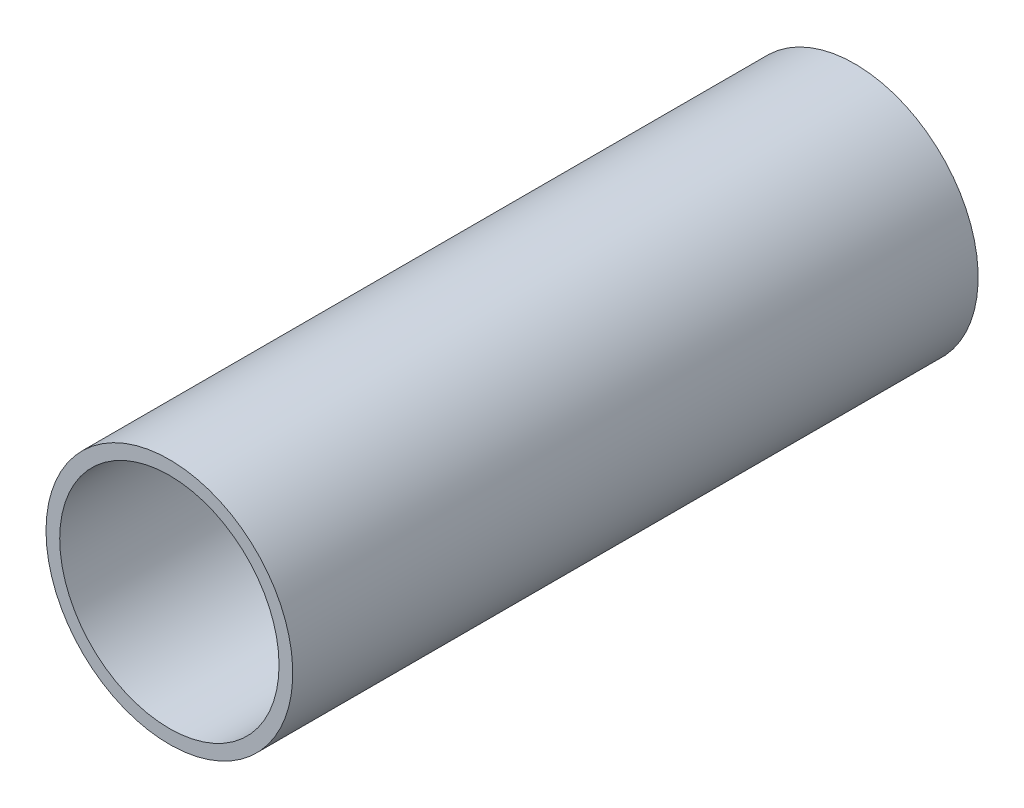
from build123d import *

# Parameters (mm, degrees)
ESQUISSE1_R          = 18
ESQUISSE1_R_2        = 16
BASE_EXTRUSION_DEPTH = 100


with BuildPart() as part:
    # Esquisse1 → Base-Extrusion (new body)
    with BuildSketch(Plane.XY):
        with Locations(Location((0, 0, 0), (0, 0, 180))):
            Circle(ESQUISSE1_R)
        with Locations(Location((0, 0, 0), (0, 0, 180))):
            Circle(ESQUISSE1_R_2, mode=Mode.SUBTRACT)
    extrude(amount=BASE_EXTRUSION_DEPTH)


solid = part.part
